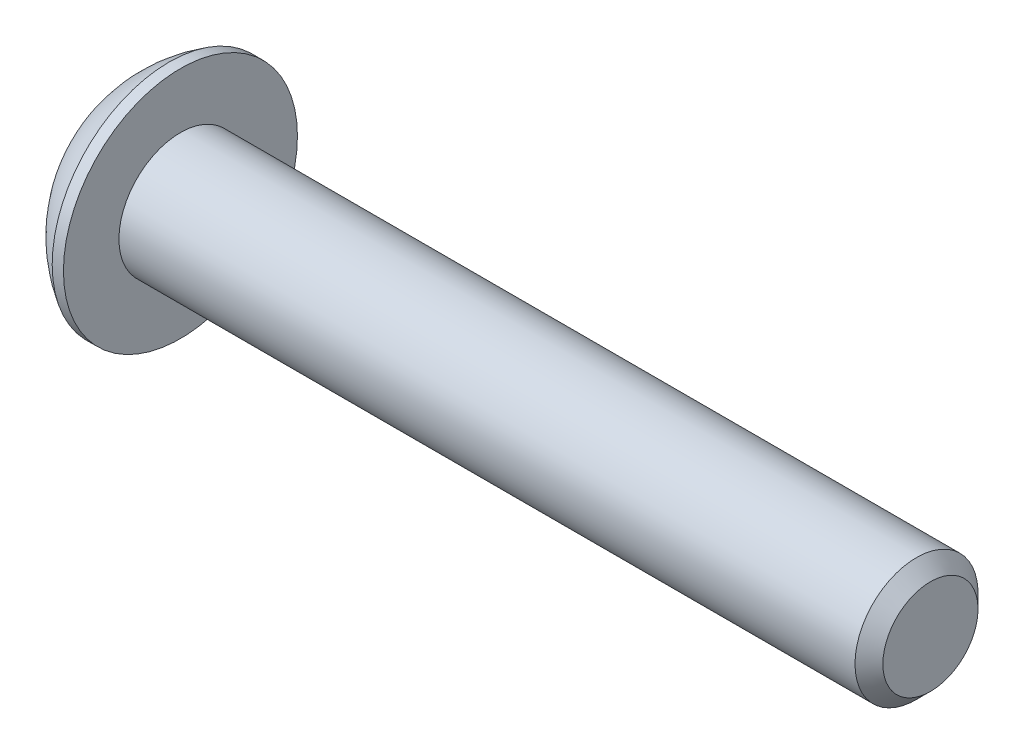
ISO-10303-21;
HEADER;
FILE_DESCRIPTION(('STEP AP214'),'2;1');
FILE_NAME('part.step','',(''),(''),'','','');
FILE_SCHEMA(('AUTOMOTIVE_DESIGN { 1 0 10303 214 1 1 1 1 }'));
ENDSEC;
DATA;
#1=APPLICATION_CONTEXT('core data for automotive mechanical design processes');
#2=APPLICATION_PROTOCOL_DEFINITION('international standard','automotive_design',2000,#1);
#3=PRODUCT_CONTEXT('',#1,'mechanical');
#4=PRODUCT('Part','Part','',(#3));
#5=PRODUCT_RELATED_PRODUCT_CATEGORY('part','',(#4));
#6=PRODUCT_DEFINITION_FORMATION('','',#4);
#7=PRODUCT_DEFINITION_CONTEXT('part definition',#1,'design');
#8=PRODUCT_DEFINITION('design','',#6,#7);
#9=PRODUCT_DEFINITION_SHAPE('','',#8);
#10=(LENGTH_UNIT() NAMED_UNIT(*) SI_UNIT(.MILLI.,.METRE.));
#11=(NAMED_UNIT(*) PLANE_ANGLE_UNIT() SI_UNIT($,.RADIAN.));
#12=(NAMED_UNIT(*) SI_UNIT($,.STERADIAN.) SOLID_ANGLE_UNIT());
#13=UNCERTAINTY_MEASURE_WITH_UNIT(LENGTH_MEASURE(1.E-05),#10,'distance_accuracy_value','');
#14=(GEOMETRIC_REPRESENTATION_CONTEXT(3) GLOBAL_UNCERTAINTY_ASSIGNED_CONTEXT((#13)) GLOBAL_UNIT_ASSIGNED_CONTEXT((#10,
#11,#12)) REPRESENTATION_CONTEXT('',''));
#15=CARTESIAN_POINT('',(0.,0.,0.));
#16=DIRECTION('',(0.,0.,1.));
#17=DIRECTION('',(1.,0.,0.));
#18=AXIS2_PLACEMENT_3D('',#15,#16,#17);
#19=CARTESIAN_POINT('',(0.,0.,0.));
#20=DIRECTION('',(-1.,0.,0.));
#21=DIRECTION('',(0.,0.,1.));
#22=AXIS2_PLACEMENT_3D('',#19,#20,#21);
#23=PLANE('',#22);
#24=CARTESIAN_POINT('',(0.,0.,0.));
#25=DIRECTION('',(-1.,0.,0.));
#26=DIRECTION('',(0.,0.,1.));
#27=AXIS2_PLACEMENT_3D('',#24,#25,#26);
#28=CIRCLE('',#27,1.9812);
#29=CARTESIAN_POINT('',(0.,1.9812,0.));
#30=VERTEX_POINT('',#29);
#31=EDGE_CURVE('E11',#30,#30,#28,.T.);
#32=ORIENTED_EDGE('',*,*,#31,.T.);
#33=EDGE_LOOP('',(#32));
#34=FACE_BOUND('',#33,.T.);
#35=DIRECTION('',(0.,-1.,0.));
#36=VECTOR('',#35,1.);
#37=CARTESIAN_POINT('',(0.,-0.689240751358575,1.1938));
#38=LINE('',#37,#36);
#39=CARTESIAN_POINT('',(0.,0.689240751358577,1.1938));
#40=VERTEX_POINT('',#39);
#41=CARTESIAN_POINT('',(0.,-0.689240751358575,1.1938));
#42=VERTEX_POINT('',#41);
#43=EDGE_CURVE('E50',#40,#42,#38,.T.);
#44=ORIENTED_EDGE('',*,*,#43,.T.);
#45=DIRECTION('',(0.,-0.5,-0.866025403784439));
#46=VECTOR('',#45,1.);
#47=CARTESIAN_POINT('',(0.,-1.37848150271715,0.));
#48=LINE('',#47,#46);
#49=CARTESIAN_POINT('',(0.,-1.37848150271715,0.));
#50=VERTEX_POINT('',#49);
#51=EDGE_CURVE('E366',#42,#50,#48,.T.);
#52=ORIENTED_EDGE('',*,*,#51,.T.);
#53=DIRECTION('',(0.,0.5,-0.866025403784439));
#54=VECTOR('',#53,1.);
#55=CARTESIAN_POINT('',(0.,-0.689240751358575,-1.1938));
#56=LINE('',#55,#54);
#57=CARTESIAN_POINT('',(0.,-0.689240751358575,-1.1938));
#58=VERTEX_POINT('',#57);
#59=EDGE_CURVE('E130',#50,#58,#56,.T.);
#60=ORIENTED_EDGE('',*,*,#59,.T.);
#61=DIRECTION('',(0.,1.,0.));
#62=VECTOR('',#61,1.);
#63=CARTESIAN_POINT('',(0.,0.689240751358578,-1.1938));
#64=LINE('',#63,#62);
#65=CARTESIAN_POINT('',(0.,0.689240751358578,-1.1938));
#66=VERTEX_POINT('',#65);
#67=EDGE_CURVE('E369',#58,#66,#64,.T.);
#68=ORIENTED_EDGE('',*,*,#67,.T.);
#69=DIRECTION('',(0.,0.5,0.866025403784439));
#70=VECTOR('',#69,1.);
#71=CARTESIAN_POINT('',(0.,1.37848150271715,0.));
#72=LINE('',#71,#70);
#73=CARTESIAN_POINT('',(0.,1.37848150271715,0.));
#74=VERTEX_POINT('',#73);
#75=EDGE_CURVE('E371',#66,#74,#72,.T.);
#76=ORIENTED_EDGE('',*,*,#75,.T.);
#77=DIRECTION('',(0.,-0.5,0.866025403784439));
#78=VECTOR('',#77,1.);
#79=CARTESIAN_POINT('',(0.,0.689240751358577,1.1938));
#80=LINE('',#79,#78);
#81=EDGE_CURVE('E373',#74,#40,#80,.T.);
#82=ORIENTED_EDGE('',*,*,#81,.T.);
#83=EDGE_LOOP('',(#44,#52,#60,#68,#76,#82));
#84=FACE_BOUND('',#83,.T.);
#85=ADVANCED_FACE('F36',(#34,#84),#23,.T.);
#86=CARTESIAN_POINT('',(4.13385000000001,0.,0.));
#87=DIRECTION('',(-1.,0.,0.));
#88=DIRECTION('',(0.,1.,0.));
#89=AXIS2_PLACEMENT_3D('',#86,#87,#88);
#90=SPHERICAL_SURFACE('',#89,4.5840887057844);
#91=CARTESIAN_POINT('',(1.8288,0.,0.));
#92=DIRECTION('',(-1.,0.,0.));
#93=DIRECTION('',(0.,0.,1.));
#94=AXIS2_PLACEMENT_3D('',#91,#92,#93);
#95=CIRCLE('',#94,3.9624);
#96=CARTESIAN_POINT('',(1.8288,3.9624,0.));
#97=VERTEX_POINT('',#96);
#98=EDGE_CURVE('E43',#97,#97,#95,.T.);
#99=CARTESIAN_POINT('',(1.8288,3.9624,0.));
#100=CARTESIAN_POINT('',(1.80415889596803,3.94806555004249,0.));
#101=CARTESIAN_POINT('',(1.77965153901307,3.93350118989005,0.));
#102=CARTESIAN_POINT('',(1.73091277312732,3.90391784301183,0.));
#103=CARTESIAN_POINT('',(1.70668136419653,3.88889885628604,0.));
#104=CARTESIAN_POINT('',(1.65850294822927,3.85841145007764,0.));
#105=CARTESIAN_POINT('',(1.63455594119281,3.84294303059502,0.));
#106=CARTESIAN_POINT('',(1.58695465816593,3.8115621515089,0.));
#107=CARTESIAN_POINT('',(1.56330038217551,3.79564969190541,0.));
#108=CARTESIAN_POINT('',(1.51629279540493,3.76338626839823,0.));
#109=CARTESIAN_POINT('',(1.49293948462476,3.74703530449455,0.));
#110=CARTESIAN_POINT('',(1.44654195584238,3.71390056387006,0.));
#111=CARTESIAN_POINT('',(1.42349773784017,3.69711678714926,0.));
#112=CARTESIAN_POINT('',(1.37772641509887,3.66312226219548,0.));
#113=CARTESIAN_POINT('',(1.35499931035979,3.6459115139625,0.));
#114=CARTESIAN_POINT('',(1.30987012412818,3.61106903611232,0.));
#115=CARTESIAN_POINT('',(1.28746804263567,3.59343730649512,0.));
#116=CARTESIAN_POINT('',(1.2429966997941,3.55775900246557,0.));
#117=CARTESIAN_POINT('',(1.22092743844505,3.53971242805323,0.));
#118=CARTESIAN_POINT('',(1.17712941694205,3.50321071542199,0.));
#119=CARTESIAN_POINT('',(1.15540065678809,3.4847555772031,0.));
#120=CARTESIAN_POINT('',(1.11229120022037,3.447443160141,0.));
#121=CARTESIAN_POINT('',(1.0909105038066,3.42858588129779,0.));
#122=CARTESIAN_POINT('',(1.04850461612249,3.39047574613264,0.));
#123=CARTESIAN_POINT('',(1.02747942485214,3.37122288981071,0.));
#124=CARTESIAN_POINT('',(0.985791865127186,3.33232830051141,0.));
#125=CARTESIAN_POINT('',(0.965129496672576,3.31268656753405,0.));
#126=CARTESIAN_POINT('',(0.924174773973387,3.27302106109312,0.));
#127=CARTESIAN_POINT('',(0.903882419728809,3.25299728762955,0.));
#128=CARTESIAN_POINT('',(0.863674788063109,3.21257466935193,0.));
#129=CARTESIAN_POINT('',(0.843759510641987,3.19217582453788,0.));
#130=CARTESIAN_POINT('',(0.804312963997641,3.15101016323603,0.));
#131=CARTESIAN_POINT('',(0.784781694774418,3.13024334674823,0.));
#132=CARTESIAN_POINT('',(0.746109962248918,3.08834896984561,0.));
#133=CARTESIAN_POINT('',(0.726969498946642,3.06722140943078,0.));
#134=CARTESIAN_POINT('',(0.68908603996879,3.02461289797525,0.));
#135=CARTESIAN_POINT('',(0.670343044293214,3.00313194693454,0.));
#136=CARTESIAN_POINT('',(0.633261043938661,2.95982413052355,0.));
#137=CARTESIAN_POINT('',(0.614922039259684,2.93799726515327,0.));
#138=CARTESIAN_POINT('',(0.578654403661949,2.89400521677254,0.));
#139=CARTESIAN_POINT('',(0.560725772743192,2.87184003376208,0.));
#140=CARTESIAN_POINT('',(0.525285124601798,2.8271790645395,0.));
#141=CARTESIAN_POINT('',(0.50777310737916,2.80468327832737,0.));
#142=CARTESIAN_POINT('',(0.473171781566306,2.75936893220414,0.));
#143=CARTESIAN_POINT('',(0.456082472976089,2.73655037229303,0.));
#144=CARTESIAN_POINT('',(0.422332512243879,2.69059842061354,0.));
#145=CARTESIAN_POINT('',(0.405671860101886,2.66746502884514,0.));
#146=CARTESIAN_POINT('',(0.37278501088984,2.62089146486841,0.));
#147=CARTESIAN_POINT('',(0.356558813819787,2.59745129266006,0.));
#148=CARTESIAN_POINT('',(0.324546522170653,2.55027232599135,0.));
#149=CARTESIAN_POINT('',(0.308760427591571,2.52653353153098,0.));
#150=CARTESIAN_POINT('',(0.277633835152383,2.47876558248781,0.));
#151=CARTESIAN_POINT('',(0.262293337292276,2.454736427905,0.));
#152=CARTESIAN_POINT('',(0.2320632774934,2.40639612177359,0.));
#153=CARTESIAN_POINT('',(0.21717371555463,2.382084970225,0.));
#154=CARTESIAN_POINT('',(0.187850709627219,2.33318913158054,0.));
#155=CARTESIAN_POINT('',(0.173417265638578,2.30860444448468,0.));
#156=CARTESIAN_POINT('',(0.145011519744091,2.25917009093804,0.));
#157=CARTESIAN_POINT('',(0.131039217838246,2.23432042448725,0.));
#158=CARTESIAN_POINT('',(0.10356061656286,2.1843647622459,0.));
#159=CARTESIAN_POINT('',(0.0900543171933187,2.15925876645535,0.));
#160=CARTESIAN_POINT('',(0.0635124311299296,2.10879917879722,0.));
#161=CARTESIAN_POINT('',(0.0504768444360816,2.08344558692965,0.));
#162=CARTESIAN_POINT('',(0.0248808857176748,2.03249964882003,0.));
#163=CARTESIAN_POINT('',(0.0123205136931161,2.00690730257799,0.));
#164=CARTESIAN_POINT('',(0.,1.9812,0.));
#165=B_SPLINE_CURVE_WITH_KNOTS('',3,(#99,#100,#101,#102,#103,#104,#105,#106,#107,#108,#109,#110,
#111,#112,#113,#114,#115,#116,#117,#118,#119,#120,#121,#122,#123,#124,#125,#126,#127,#128,#129,
#130,#131,#132,#133,#134,#135,#136,#137,#138,#139,#140,#141,#142,#143,#144,#145,#146,#147,#148,
#149,#150,#151,#152,#153,#154,#155,#156,#157,#158,#159,#160,#161,#162,#163,#164),.UNSPECIFIED.,
.F.,.F.,(4,2,2,2,2,2,2,2,2,2,2,2,2,2,2,2,2,2,2,2,2,2,2,2,2,2,2,2,2,2,2,2,4),(0.,
0.0855203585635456,0.17104071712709,0.256561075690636,0.342081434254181,0.427601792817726,
0.513122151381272,0.598642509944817,0.684162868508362,0.769683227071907,0.855203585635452,
0.940723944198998,1.02624430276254,1.11176466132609,1.19728501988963,1.28280537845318,
1.36832573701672,1.45384609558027,1.53936645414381,1.62488681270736,1.7104071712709,
1.79592752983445,1.881447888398,1.96696824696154,2.05248860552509,2.13800896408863,
2.22352932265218,2.30904968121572,2.39457003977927,2.48009039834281,2.56561075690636,
2.6511311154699,2.73665147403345),.UNSPECIFIED.);
#166=EDGE_CURVE('BSEAM157',#97,#30,#165,.T.);
#167=ORIENTED_EDGE('',*,*,#98,.T.);
#168=ORIENTED_EDGE('',*,*,#31,.F.);
#169=ORIENTED_EDGE('',*,*,#166,.T.);
#170=ORIENTED_EDGE('',*,*,#166,.F.);
#171=EDGE_LOOP('',(#167,#169,#168,#170));
#172=FACE_BOUND('',#171,.T.);
#173=ADVANCED_FACE('F157',(#172),#90,.T.);
#174=CARTESIAN_POINT('',(0.,0.,0.));
#175=DIRECTION('',(-1.,0.,0.));
#176=DIRECTION('',(0.,0.,1.));
#177=AXIS2_PLACEMENT_3D('',#174,#175,#176);
#178=CYLINDRICAL_SURFACE('',#177,3.9624);
#179=ORIENTED_EDGE('',*,*,#98,.F.);
#180=EDGE_LOOP('',(#179));
#181=FACE_BOUND('',#180,.T.);
#182=CARTESIAN_POINT('',(2.2098,0.,0.));
#183=DIRECTION('',(-1.,0.,0.));
#184=DIRECTION('',(0.,0.,1.));
#185=AXIS2_PLACEMENT_3D('',#182,#183,#184);
#186=CIRCLE('',#185,3.9624);
#187=CARTESIAN_POINT('',(2.2098,0.,3.9624));
#188=VERTEX_POINT('',#187);
#189=EDGE_CURVE('E152',#188,#188,#186,.T.);
#190=ORIENTED_EDGE('',*,*,#189,.T.);
#191=EDGE_LOOP('',(#190));
#192=FACE_BOUND('',#191,.T.);
#193=ADVANCED_FACE('F160',(#181,#192),#178,.T.);
#194=CARTESIAN_POINT('',(2.2098,2.08279999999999,0.));
#195=DIRECTION('',(-1.,0.,0.));
#196=DIRECTION('',(0.,0.,1.));
#197=AXIS2_PLACEMENT_3D('',#194,#195,#196);
#198=PLANE('',#197);
#199=ORIENTED_EDGE('',*,*,#189,.F.);
#200=EDGE_LOOP('',(#199));
#201=FACE_BOUND('',#200,.T.);
#202=CARTESIAN_POINT('',(2.2098,0.,0.));
#203=DIRECTION('',(-1.,0.,0.));
#204=DIRECTION('',(0.,0.,1.));
#205=AXIS2_PLACEMENT_3D('',#202,#203,#204);
#206=CIRCLE('',#205,2.08279999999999);
#207=CARTESIAN_POINT('',(2.2098,0.,2.08279999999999));
#208=VERTEX_POINT('',#207);
#209=EDGE_CURVE('E149',#208,#208,#206,.T.);
#210=ORIENTED_EDGE('',*,*,#209,.T.);
#211=EDGE_LOOP('',(#210));
#212=FACE_BOUND('',#211,.T.);
#213=ADVANCED_FACE('F163',(#201,#212),#198,.F.);
#214=CARTESIAN_POINT('',(0.,0.,0.));
#215=DIRECTION('',(-1.,0.,0.));
#216=DIRECTION('',(0.,0.,1.));
#217=AXIS2_PLACEMENT_3D('',#214,#215,#216);
#218=CYLINDRICAL_SURFACE('',#217,2.0828);
#219=ORIENTED_EDGE('',*,*,#209,.F.);
#220=EDGE_LOOP('',(#219));
#221=FACE_BOUND('',#220,.T.);
#222=CARTESIAN_POINT('',(27.13736,0.,0.));
#223=DIRECTION('',(-1.,0.,0.));
#224=DIRECTION('',(0.,0.,1.));
#225=AXIS2_PLACEMENT_3D('',#222,#223,#224);
#226=CIRCLE('',#225,2.0828);
#227=CARTESIAN_POINT('',(27.13736,0.,2.0828));
#228=VERTEX_POINT('',#227);
#229=EDGE_CURVE('E146',#228,#228,#226,.T.);
#230=ORIENTED_EDGE('',*,*,#229,.T.);
#231=EDGE_LOOP('',(#230));
#232=FACE_BOUND('',#231,.T.);
#233=ADVANCED_FACE('F169',(#221,#232),#218,.T.);
#234=CARTESIAN_POINT('',(27.6098,0.,0.));
#235=DIRECTION('',(-1.,0.,0.));
#236=DIRECTION('',(0.,0.,1.));
#237=AXIS2_PLACEMENT_3D('',#234,#235,#236);
#238=CONICAL_SURFACE('',#237,1.61036,0.785398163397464);
#239=ORIENTED_EDGE('',*,*,#229,.F.);
#240=EDGE_LOOP('',(#239));
#241=FACE_BOUND('',#240,.T.);
#242=CARTESIAN_POINT('',(27.6098,0.,0.));
#243=DIRECTION('',(-1.,0.,0.));
#244=DIRECTION('',(0.,0.,1.));
#245=AXIS2_PLACEMENT_3D('',#242,#243,#244);
#246=CIRCLE('',#245,1.61036);
#247=CARTESIAN_POINT('',(27.6098,0.,1.61036));
#248=VERTEX_POINT('',#247);
#249=EDGE_CURVE('E142',#248,#248,#246,.T.);
#250=ORIENTED_EDGE('',*,*,#249,.T.);
#251=EDGE_LOOP('',(#250));
#252=FACE_BOUND('',#251,.T.);
#253=ADVANCED_FACE('F175',(#241,#252),#238,.T.);
#254=CARTESIAN_POINT('',(27.6098,0.,0.));
#255=DIRECTION('',(-1.,0.,0.));
#256=DIRECTION('',(0.,0.,1.));
#257=AXIS2_PLACEMENT_3D('',#254,#255,#256);
#258=PLANE('',#257);
#259=ORIENTED_EDGE('',*,*,#249,.F.);
#260=EDGE_LOOP('',(#259));
#261=FACE_BOUND('',#260,.T.);
#262=ADVANCED_FACE('F181',(#261),#258,.F.);
#263=CARTESIAN_POINT('',(1.3208,-1.37848150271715,0.));
#264=DIRECTION('',(0.,0.866025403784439,-0.5));
#265=DIRECTION('',(0.,0.5,0.866025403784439));
#266=AXIS2_PLACEMENT_3D('',#263,#264,#265);
#267=PLANE('',#266);
#268=DIRECTION('',(0.,-0.5,-0.866025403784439));
#269=VECTOR('',#268,1.);
#270=CARTESIAN_POINT('',(1.3208,-1.37848150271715,0.));
#271=LINE('',#270,#269);
#272=CARTESIAN_POINT('',(1.3208,-0.689240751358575,1.1938));
#273=VERTEX_POINT('',#272);
#274=CARTESIAN_POINT('',(1.3208,-1.03386112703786,0.596899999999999));
#275=VERTEX_POINT('',#274);
#276=EDGE_CURVE('E116',#273,#275,#271,.T.);
#277=ORIENTED_EDGE('',*,*,#276,.T.);
#278=CARTESIAN_POINT('',(1.3208,-1.37848150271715,0.));
#279=VERTEX_POINT('',#278);
#280=EDGE_CURVE('E111',#275,#279,#271,.T.);
#281=ORIENTED_EDGE('',*,*,#280,.T.);
#282=DIRECTION('',(-1.,0.,0.));
#283=VECTOR('',#282,1.);
#284=CARTESIAN_POINT('',(1.3208,-1.37848150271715,0.));
#285=LINE('',#284,#283);
#286=EDGE_CURVE('E113',#279,#50,#285,.T.);
#287=ORIENTED_EDGE('',*,*,#286,.T.);
#288=ORIENTED_EDGE('',*,*,#51,.F.);
#289=DIRECTION('',(-1.,0.,0.));
#290=VECTOR('',#289,1.);
#291=CARTESIAN_POINT('',(1.3208,-0.689240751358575,1.1938));
#292=LINE('',#291,#290);
#293=EDGE_CURVE('E361',#273,#42,#292,.T.);
#294=ORIENTED_EDGE('',*,*,#293,.F.);
#295=EDGE_LOOP('',(#277,#281,#287,#288,#294));
#296=FACE_BOUND('',#295,.T.);
#297=ADVANCED_FACE('F112',(#296),#267,.T.);
#298=CARTESIAN_POINT('',(1.3208,-0.689240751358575,-1.1938));
#299=DIRECTION('',(0.,0.866025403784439,0.5));
#300=DIRECTION('',(0.,-0.5,0.866025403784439));
#301=AXIS2_PLACEMENT_3D('',#298,#299,#300);
#302=PLANE('',#301);
#303=DIRECTION('',(0.,0.5,-0.866025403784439));
#304=VECTOR('',#303,1.);
#305=CARTESIAN_POINT('',(1.3208,-0.689240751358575,-1.1938));
#306=LINE('',#305,#304);
#307=CARTESIAN_POINT('',(1.3208,-1.03386112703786,-0.5969));
#308=VERTEX_POINT('',#307);
#309=EDGE_CURVE('E58',#279,#308,#306,.T.);
#310=ORIENTED_EDGE('',*,*,#309,.T.);
#311=CARTESIAN_POINT('',(1.3208,-0.689240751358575,-1.1938));
#312=VERTEX_POINT('',#311);
#313=EDGE_CURVE('E125',#308,#312,#306,.T.);
#314=ORIENTED_EDGE('',*,*,#313,.T.);
#315=DIRECTION('',(-1.,0.,0.));
#316=VECTOR('',#315,1.);
#317=CARTESIAN_POINT('',(1.3208,-0.689240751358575,-1.1938));
#318=LINE('',#317,#316);
#319=EDGE_CURVE('E132',#312,#58,#318,.T.);
#320=ORIENTED_EDGE('',*,*,#319,.T.);
#321=ORIENTED_EDGE('',*,*,#59,.F.);
#322=ORIENTED_EDGE('',*,*,#286,.F.);
#323=EDGE_LOOP('',(#310,#314,#320,#321,#322));
#324=FACE_BOUND('',#323,.T.);
#325=ADVANCED_FACE('F128',(#324),#302,.T.);
#326=CARTESIAN_POINT('',(1.3208,0.689240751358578,-1.1938));
#327=DIRECTION('',(0.,0.,1.));
#328=DIRECTION('',(0.,-1.,0.));
#329=AXIS2_PLACEMENT_3D('',#326,#327,#328);
#330=PLANE('',#329);
#331=DIRECTION('',(0.,1.,0.));
#332=VECTOR('',#331,1.);
#333=CARTESIAN_POINT('',(1.3208,0.689240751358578,-1.1938));
#334=LINE('',#333,#332);
#335=CARTESIAN_POINT('',(1.3208,0.,-1.1938));
#336=VERTEX_POINT('',#335);
#337=EDGE_CURVE('E391',#312,#336,#334,.T.);
#338=ORIENTED_EDGE('',*,*,#337,.T.);
#339=CARTESIAN_POINT('',(1.3208,0.689240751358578,-1.1938));
#340=VERTEX_POINT('',#339);
#341=EDGE_CURVE('E124',#336,#340,#334,.T.);
#342=ORIENTED_EDGE('',*,*,#341,.T.);
#343=DIRECTION('',(-1.,0.,0.));
#344=VECTOR('',#343,1.);
#345=CARTESIAN_POINT('',(1.3208,0.689240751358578,-1.1938));
#346=LINE('',#345,#344);
#347=EDGE_CURVE('E137',#340,#66,#346,.T.);
#348=ORIENTED_EDGE('',*,*,#347,.T.);
#349=ORIENTED_EDGE('',*,*,#67,.F.);
#350=ORIENTED_EDGE('',*,*,#319,.F.);
#351=EDGE_LOOP('',(#338,#342,#348,#349,#350));
#352=FACE_BOUND('',#351,.T.);
#353=ADVANCED_FACE('F240',(#352),#330,.T.);
#354=CARTESIAN_POINT('',(1.3208,1.37848150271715,0.));
#355=DIRECTION('',(0.,-0.866025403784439,0.5));
#356=DIRECTION('',(0.,-0.5,-0.866025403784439));
#357=AXIS2_PLACEMENT_3D('',#354,#355,#356);
#358=PLANE('',#357);
#359=DIRECTION('',(0.,0.5,0.866025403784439));
#360=VECTOR('',#359,1.);
#361=CARTESIAN_POINT('',(1.3208,1.37848150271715,0.));
#362=LINE('',#361,#360);
#363=CARTESIAN_POINT('',(1.3208,1.03386112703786,-0.596900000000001));
#364=VERTEX_POINT('',#363);
#365=EDGE_CURVE('E395',#340,#364,#362,.T.);
#366=ORIENTED_EDGE('',*,*,#365,.T.);
#367=CARTESIAN_POINT('',(1.3208,1.37848150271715,0.));
#368=VERTEX_POINT('',#367);
#369=EDGE_CURVE('E393',#364,#368,#362,.T.);
#370=ORIENTED_EDGE('',*,*,#369,.T.);
#371=DIRECTION('',(-1.,0.,0.));
#372=VECTOR('',#371,1.);
#373=CARTESIAN_POINT('',(1.3208,1.37848150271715,0.));
#374=LINE('',#373,#372);
#375=EDGE_CURVE('E377',#368,#74,#374,.T.);
#376=ORIENTED_EDGE('',*,*,#375,.T.);
#377=ORIENTED_EDGE('',*,*,#75,.F.);
#378=ORIENTED_EDGE('',*,*,#347,.F.);
#379=EDGE_LOOP('',(#366,#370,#376,#377,#378));
#380=FACE_BOUND('',#379,.T.);
#381=ADVANCED_FACE('F249',(#380),#358,.T.);
#382=CARTESIAN_POINT('',(1.3208,0.689240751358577,1.1938));
#383=DIRECTION('',(0.,-0.866025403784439,-0.5));
#384=DIRECTION('',(0.,0.5,-0.866025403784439));
#385=AXIS2_PLACEMENT_3D('',#382,#383,#384);
#386=PLANE('',#385);
#387=DIRECTION('',(0.,-0.5,0.866025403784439));
#388=VECTOR('',#387,1.);
#389=CARTESIAN_POINT('',(1.3208,0.689240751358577,1.1938));
#390=LINE('',#389,#388);
#391=CARTESIAN_POINT('',(1.3208,1.03386112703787,0.596900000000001));
#392=VERTEX_POINT('',#391);
#393=EDGE_CURVE('E356',#368,#392,#390,.T.);
#394=ORIENTED_EDGE('',*,*,#393,.T.);
#395=CARTESIAN_POINT('',(1.3208,0.689240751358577,1.1938));
#396=VERTEX_POINT('',#395);
#397=EDGE_CURVE('E352',#392,#396,#390,.T.);
#398=ORIENTED_EDGE('',*,*,#397,.T.);
#399=DIRECTION('',(-1.,0.,0.));
#400=VECTOR('',#399,1.);
#401=CARTESIAN_POINT('',(1.3208,0.689240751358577,1.1938));
#402=LINE('',#401,#400);
#403=EDGE_CURVE('E360',#396,#40,#402,.T.);
#404=ORIENTED_EDGE('',*,*,#403,.T.);
#405=ORIENTED_EDGE('',*,*,#81,.F.);
#406=ORIENTED_EDGE('',*,*,#375,.F.);
#407=EDGE_LOOP('',(#394,#398,#404,#405,#406));
#408=FACE_BOUND('',#407,.T.);
#409=ADVANCED_FACE('F259',(#408),#386,.T.);
#410=CARTESIAN_POINT('',(1.3208,-0.689240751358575,1.1938));
#411=DIRECTION('',(0.,0.,-1.));
#412=DIRECTION('',(0.,1.,0.));
#413=AXIS2_PLACEMENT_3D('',#410,#411,#412);
#414=PLANE('',#413);
#415=DIRECTION('',(0.,-1.,0.));
#416=VECTOR('',#415,1.);
#417=CARTESIAN_POINT('',(1.3208,-0.689240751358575,1.1938));
#418=LINE('',#417,#416);
#419=CARTESIAN_POINT('',(1.3208,0.,1.1938));
#420=VERTEX_POINT('',#419);
#421=EDGE_CURVE('E351',#396,#420,#418,.T.);
#422=ORIENTED_EDGE('',*,*,#421,.T.);
#423=EDGE_CURVE('E354',#420,#273,#418,.T.);
#424=ORIENTED_EDGE('',*,*,#423,.T.);
#425=ORIENTED_EDGE('',*,*,#293,.T.);
#426=ORIENTED_EDGE('',*,*,#43,.F.);
#427=ORIENTED_EDGE('',*,*,#403,.F.);
#428=EDGE_LOOP('',(#422,#424,#425,#426,#427));
#429=FACE_BOUND('',#428,.T.);
#430=ADVANCED_FACE('F269',(#429),#414,.T.);
#431=CARTESIAN_POINT('',(1.3208,-2.06772225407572,-1.1938));
#432=DIRECTION('',(1.,0.,0.));
#433=DIRECTION('',(0.,0.,-1.));
#434=AXIS2_PLACEMENT_3D('',#431,#432,#433);
#435=PLANE('',#434);
#436=CARTESIAN_POINT('',(1.3208,0.,0.));
#437=DIRECTION('',(-1.,0.,0.));
#438=DIRECTION('',(0.,0.,1.));
#439=AXIS2_PLACEMENT_3D('',#436,#437,#438);
#440=CIRCLE('',#439,1.1938);
#441=EDGE_CURVE('E398',#364,#336,#440,.T.);
#442=ORIENTED_EDGE('',*,*,#441,.F.);
#443=ORIENTED_EDGE('',*,*,#365,.F.);
#444=ORIENTED_EDGE('',*,*,#341,.F.);
#445=EDGE_LOOP('',(#442,#443,#444));
#446=FACE_BOUND('',#445,.T.);
#447=ADVANCED_FACE('F279',(#446),#435,.F.);
#448=EDGE_CURVE('E143',#392,#364,#440,.T.);
#449=ORIENTED_EDGE('',*,*,#448,.F.);
#450=ORIENTED_EDGE('',*,*,#393,.F.);
#451=ORIENTED_EDGE('',*,*,#369,.F.);
#452=EDGE_LOOP('',(#449,#450,#451));
#453=FACE_BOUND('',#452,.T.);
#454=ADVANCED_FACE('F289',(#453),#435,.F.);
#455=EDGE_CURVE('E136',#420,#392,#440,.T.);
#456=ORIENTED_EDGE('',*,*,#455,.F.);
#457=ORIENTED_EDGE('',*,*,#421,.F.);
#458=ORIENTED_EDGE('',*,*,#397,.F.);
#459=EDGE_LOOP('',(#456,#457,#458));
#460=FACE_BOUND('',#459,.T.);
#461=ADVANCED_FACE('F300',(#460),#435,.F.);
#462=EDGE_CURVE('E131',#275,#420,#440,.T.);
#463=ORIENTED_EDGE('',*,*,#462,.F.);
#464=ORIENTED_EDGE('',*,*,#276,.F.);
#465=ORIENTED_EDGE('',*,*,#423,.F.);
#466=EDGE_LOOP('',(#463,#464,#465));
#467=FACE_BOUND('',#466,.T.);
#468=ADVANCED_FACE('F309',(#467),#435,.F.);
#469=EDGE_CURVE('E122',#308,#275,#440,.T.);
#470=ORIENTED_EDGE('',*,*,#469,.F.);
#471=ORIENTED_EDGE('',*,*,#309,.F.);
#472=ORIENTED_EDGE('',*,*,#280,.F.);
#473=EDGE_LOOP('',(#470,#471,#472));
#474=FACE_BOUND('',#473,.T.);
#475=ADVANCED_FACE('F121',(#474),#435,.F.);
#476=EDGE_CURVE('E392',#336,#308,#440,.T.);
#477=ORIENTED_EDGE('',*,*,#476,.F.);
#478=ORIENTED_EDGE('',*,*,#337,.F.);
#479=ORIENTED_EDGE('',*,*,#313,.F.);
#480=EDGE_LOOP('',(#477,#478,#479));
#481=FACE_BOUND('',#480,.T.);
#482=ADVANCED_FACE('F292',(#481),#435,.F.);
#483=CARTESIAN_POINT('',(2.01004075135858,0.,0.));
#484=DIRECTION('',(-1.,0.,0.));
#485=DIRECTION('',(0.,0.,1.));
#486=AXIS2_PLACEMENT_3D('',#483,#484,#485);
#487=CONICAL_SURFACE('',#486,0.,1.04719755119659);
#488=ORIENTED_EDGE('',*,*,#455,.T.);
#489=ORIENTED_EDGE('',*,*,#448,.T.);
#490=ORIENTED_EDGE('',*,*,#441,.T.);
#491=ORIENTED_EDGE('',*,*,#476,.T.);
#492=ORIENTED_EDGE('',*,*,#469,.T.);
#493=ORIENTED_EDGE('',*,*,#462,.T.);
#494=EDGE_LOOP('',(#488,#489,#490,#491,#492,#493));
#495=FACE_BOUND('',#494,.T.);
#496=CARTESIAN_POINT('',(2.01004075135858,0.,0.));
#497=VERTEX_POINT('',#496);
#498=VERTEX_LOOP('',#497);
#499=FACE_BOUND('',#498,.T.);
#500=ADVANCED_FACE('F333',(#495,#499),#487,.F.);
#501=CLOSED_SHELL('',(#85,#173,#193,#213,#233,#253,#262,#297,#325,#353,#381,#409,#430,#447,#454,
#461,#468,#475,#482,#500));
#502=MANIFOLD_SOLID_BREP('B2',#501);
#503=ADVANCED_BREP_SHAPE_REPRESENTATION('',(#18,#502),#14);
#504=SHAPE_DEFINITION_REPRESENTATION(#9,#503);
ENDSEC;
END-ISO-10303-21;
